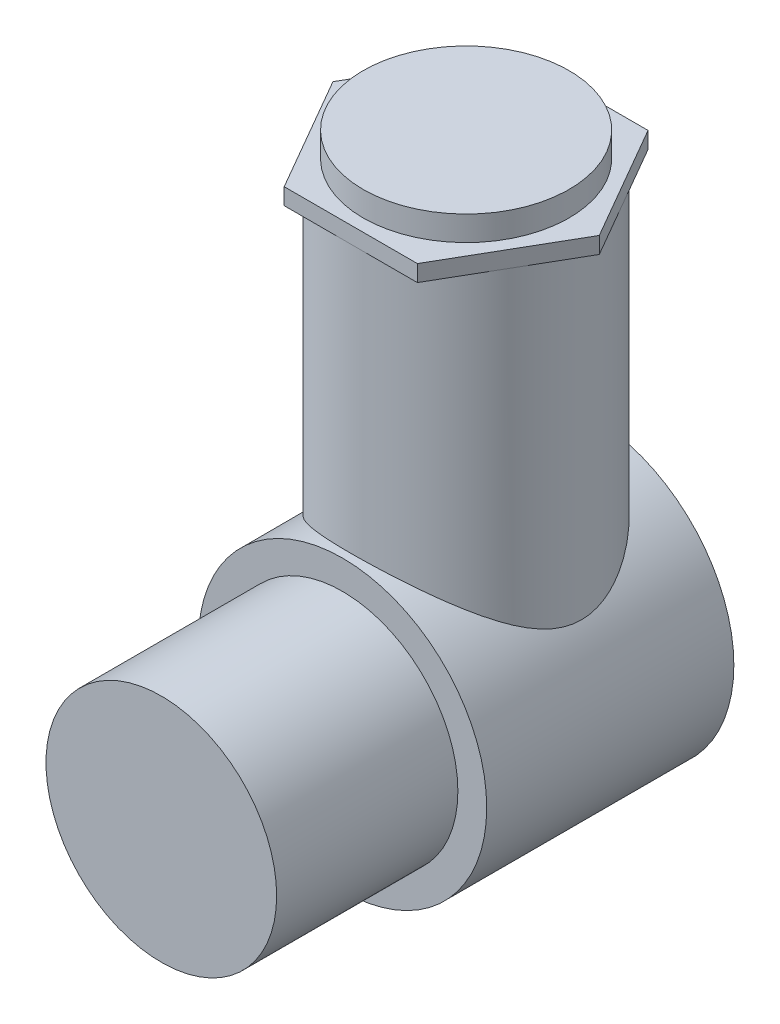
from build123d import *

# Parameters (mm, degrees)
SKETCH1_R           = 175
BOSS_EXTRUDE1_DEPTH = 150
SKETCH2_R           = 140
BOSS_EXTRUDE2_DEPTH = 220
SKETCH3_R           = 140
BOSS_EXTRUDE3_DEPTH = 500
BOSS_EXTRUDE4_DEPTH = 20
SKETCH5_R           = 125
BOSS_EXTRUDE5_DEPTH = 30


with BuildPart() as part:
    # Sketch1 → Boss-Extrude1 (new, symmetric)
    with BuildSketch(Plane.XY):
        Circle(SKETCH1_R)
    extrude(amount=BOSS_EXTRUDE1_DEPTH, both=True)

    # Sketch2 → Boss-Extrude2 (add)
    with BuildSketch(Plane.XY.offset(150)):
        Circle(SKETCH2_R)
    extrude(amount=BOSS_EXTRUDE2_DEPTH)

    # Sketch3 → Boss-Extrude3 (add)
    with BuildSketch(Plane(origin=(0, 0, 0), x_dir=(1, 0, 0), z_dir=(0, 1, 0))):
        with Locations(Location((0, 0, 0), (0, 0, 90))):
            Circle(SKETCH3_R)
    extrude(amount=BOSS_EXTRUDE3_DEPTH)

    # Sketch4 → Boss-Extrude4 (add)
    with BuildSketch(Plane(origin=(0, 500, 0), x_dir=(1, 0, 0), z_dir=(0, 1, 0))):
        Polygon((80.829037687, 140), (-80.829037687, 140), (-161.658075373, 0), (-80.829037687, -140), (80.829037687, -140), (161.658075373, 0), align=None)
    extrude(amount=BOSS_EXTRUDE4_DEPTH)

    # Sketch5 → Boss-Extrude5 (add)
    with BuildSketch(Plane(origin=(0, 520, 0), x_dir=(1, 0, 0), z_dir=(0, 1, 0))):
        with Locations(Location((0, 0, 0), (0, 0, 270))):
            Circle(SKETCH5_R)
    extrude(amount=BOSS_EXTRUDE5_DEPTH)


solid = part.part
